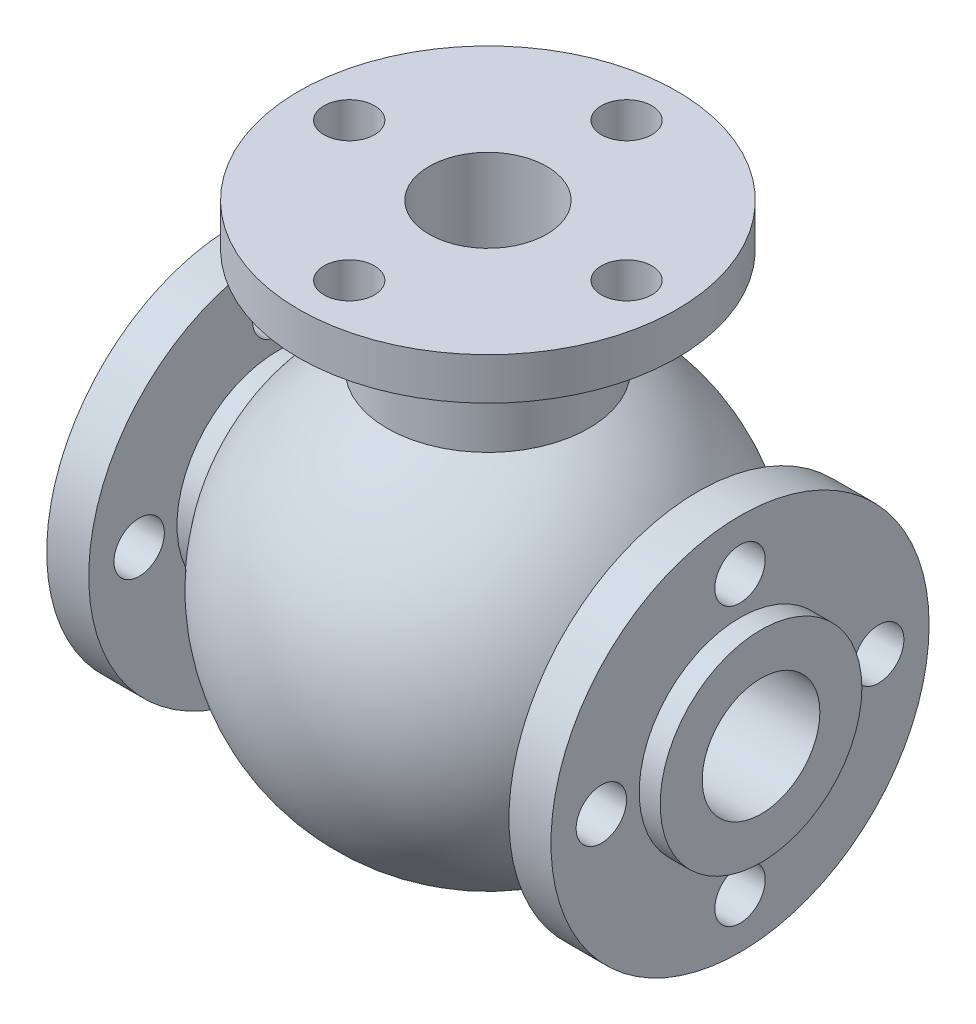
from build123d import *

# Parameters (mm, degrees)
BOSS_EXTRUDE1_REACH      = 148.516
BOSS_EXTRUDE1_END_RADIUS = 51
SKETCH2_R                = 24
SKETCH3_R                = 45
BOSS_EXTRUDE2_DEPTH      = 10
CUT_EXTRUDE1_REACH       = 156.877
CUT_EXTRUDE1_END_RADIUS  = 41
SKETCH4_R                = 14
CUT_EXTRUDE2_REACH       = 158.927
SKETCH5_R                = 6
CIRPATTERN1_COUNT        = 4
MIRROR2_COPY_1_REACH     = 158.927
MIRROR2_COPY_1_SKETCH_R  = 6
MIRROR2_COPY_2_REACH     = 158.927
MIRROR2_COPY_2_SKETCH_R  = 6
MIRROR2_COPY_3_REACH     = 158.927
MIRROR2_COPY_3_SKETCH_R  = 6
CUT_EXTRUDE3_REACH       = 156.877
SKETCH6_R                = 6
CIRPATTERN2_COUNT        = 4


with BuildPart() as part:
    # Sketch1 → Revolve1 (revolve)
    with BuildSketch(Plane.XY, mode=Mode.PRIVATE) as revolve1_sk:
        with BuildLine():
            Line((38.535697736, 14), (65, 14))
            Line((65, 14), (65, 24))
            Line((65, 24), (60, 24))
            Line((60, 24), (60, 45))
            Line((60, 45), (50, 45))
            Line((50, 45), (50, 24))
            Line((50, 24), (45, 24))
            ThreePointArc((45, 24), (0, 51), (-45, 24))
            Line((-45, 24), (-50, 24))
            Line((-50, 24), (-50, 45))
            Line((-50, 45), (-60, 45))
            Line((-60, 45), (-60, 24))
            Line((-60, 24), (-65, 24))
            Line((-65, 24), (-65, 14))
            Line((-65, 14), (-38.535697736, 14))
            ThreePointArc((-38.535697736, 14), (0, 41), (38.535697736, 14))
        make_face()
    revolve(revolve1_sk.sketch.rotate(Axis((53.911000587, 0, 0), (-1, 0, 0)), 90), axis=Axis((53.911000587, 0, 0), (-1, 0, 0)))

    # Boss-Extrude1: up to this sphere (the profile starts outside it)
    boss_extrude1_end = Location((0, 0, 0)) * Sphere(BOSS_EXTRUDE1_END_RADIUS, mode=Mode.PRIVATE)
    # Sketch2 → Boss-Extrude1 (add, up to the surface)
    with BuildSketch(Plane(origin=(0, 70, 0), x_dir=(1, 0, 0), z_dir=(0, 1, 0)), mode=Mode.PRIVATE) as boss_extrude1_sk1:
        with Locations(Location((0, 0, 0), (0, 0, 270))):
            Circle(SKETCH2_R)
    boss_extrude1_tool1 = extrude(boss_extrude1_sk1.sketch, amount=-BOSS_EXTRUDE1_REACH, mode=Mode.PRIVATE) - boss_extrude1_end
    add(boss_extrude1_tool1.solids().sort_by_distance((0, 70, 0))[0])

    # Sketch3 → Boss-Extrude2 (add)
    with BuildSketch(Plane(origin=(0, 70, 0), x_dir=(1, 0, 0), z_dir=(0, 1, 0))):
        with Locations(Location((0, 0, 0), (0, 0, 270))):
            Circle(SKETCH3_R)
    extrude(amount=BOSS_EXTRUDE2_DEPTH)

    # Cut-Extrude1: up to this sphere (the profile starts outside it)
    cut_extrude1_end = Location((0, 0, 0)) * Sphere(CUT_EXTRUDE1_END_RADIUS, mode=Mode.PRIVATE)
    # Sketch4 → Cut-Extrude1 (cut, up to the surface)
    with BuildSketch(Plane(origin=(0, 80, 0), x_dir=(1, 0, 0), z_dir=(0, 1, 0)), mode=Mode.PRIVATE) as cut_extrude1_sk1:
        with Locations(Location((0, 0, 0), (0, 0, 270))):
            Circle(SKETCH4_R)
    cut_extrude1_tool1 = extrude(cut_extrude1_sk1.sketch, amount=-CUT_EXTRUDE1_REACH, mode=Mode.PRIVATE) - cut_extrude1_end
    add(cut_extrude1_tool1.solids().sort_by_distance((0, 80, 0))[0], mode=Mode.SUBTRACT)

    # Sketch5 → Cut-Extrude2 (cut, up to next)
    with BuildSketch(Plane(origin=(60, 0, 0), x_dir=(0, 0, -1), z_dir=(1, 0, 0)), mode=Mode.PRIVATE) as cut_extrude2_sk1:
        with Locations((0, 33)):
            Circle(SKETCH5_R)
    cut_extrude2_tool1 = extrude(cut_extrude2_sk1.sketch, amount=-CUT_EXTRUDE2_REACH, mode=Mode.PRIVATE) & part.part
    cut_extrude2 = cut_extrude2_tool1.solids().sort_by_distance((60, 33, 0))[0]
    add(cut_extrude2, mode=Mode.SUBTRACT)

    # CirPattern1: Cut-Extrude2 ×4 about axis
    cirpattern1_axis = Axis((0, 0, 0), (1, 0, 0))
    for i in range(1, CIRPATTERN1_COUNT):
        add(cut_extrude2.rotate(cirpattern1_axis, i * 360 / CIRPATTERN1_COUNT), mode=Mode.SUBTRACT)

    # Mirror2: Cut-Extrude2 across plane
    add(cut_extrude2.mirror(Plane(origin=(0, 0, 0), x_dir=(0, 0, 1), z_dir=(1, 0, 0))), mode=Mode.SUBTRACT)

    # Mirror2 copy 1 sketch → Mirror2 copy 1 (cut, up to next)
    with BuildSketch(Plane(origin=(-60, 0, 0), x_dir=(0, 1, 0), z_dir=(-1, 0, 0)), mode=Mode.PRIVATE) as mirror2_copy_1_sk1:
        with Locations((0, -33)):
            Circle(MIRROR2_COPY_1_SKETCH_R)
    mirror2_copy_1_tool1 = extrude(mirror2_copy_1_sk1.sketch, amount=-MIRROR2_COPY_1_REACH, mode=Mode.PRIVATE) & part.part
    add(mirror2_copy_1_tool1.solids().sort_by_distance((-60, 0, 33))[0], mode=Mode.SUBTRACT)

    # Mirror2 copy 2 sketch → Mirror2 copy 2 (cut, up to next)
    with BuildSketch(Plane.ZY.offset(60), mode=Mode.PRIVATE) as mirror2_copy_2_sk1:
        with Locations((0, -33)):
            Circle(MIRROR2_COPY_2_SKETCH_R)
    mirror2_copy_2_tool1 = extrude(mirror2_copy_2_sk1.sketch, amount=-MIRROR2_COPY_2_REACH, mode=Mode.PRIVATE) & part.part
    add(mirror2_copy_2_tool1.solids().sort_by_distance((-60, -33, 0))[0], mode=Mode.SUBTRACT)

    # Mirror2 copy 3 sketch → Mirror2 copy 3 (cut, up to next)
    with BuildSketch(Plane(origin=(-60, 0, 0), x_dir=(0, -1, 0), z_dir=(-1, 0, 0)), mode=Mode.PRIVATE) as mirror2_copy_3_sk1:
        with Locations((0, -33)):
            Circle(MIRROR2_COPY_3_SKETCH_R)
    mirror2_copy_3_tool1 = extrude(mirror2_copy_3_sk1.sketch, amount=-MIRROR2_COPY_3_REACH, mode=Mode.PRIVATE) & part.part
    add(mirror2_copy_3_tool1.solids().sort_by_distance((-60, 0, -33))[0], mode=Mode.SUBTRACT)

    # Sketch6 → Cut-Extrude3 (cut, up to next)
    with BuildSketch(Plane(origin=(0, 80, 0), x_dir=(1, 0, 0), z_dir=(0, 1, 0)), mode=Mode.PRIVATE) as cut_extrude3_sk1:
        with Locations(Location((0, 33, 0), (0, 0, 270))):
            Circle(SKETCH6_R)
    cut_extrude3_tool1 = extrude(cut_extrude3_sk1.sketch, amount=-CUT_EXTRUDE3_REACH, mode=Mode.PRIVATE) & part.part
    cut_extrude3 = cut_extrude3_tool1.solids().sort_by_distance((0, 80, -33))[0]
    add(cut_extrude3, mode=Mode.SUBTRACT)

    # CirPattern2: Cut-Extrude3 ×4 about axis
    cirpattern2_axis = Axis((0, 0, 0), (0, 1, 0))
    for i in range(1, CIRPATTERN2_COUNT):
        add(cut_extrude3.rotate(cirpattern2_axis, i * 360 / CIRPATTERN2_COUNT), mode=Mode.SUBTRACT)


solid = part.part
